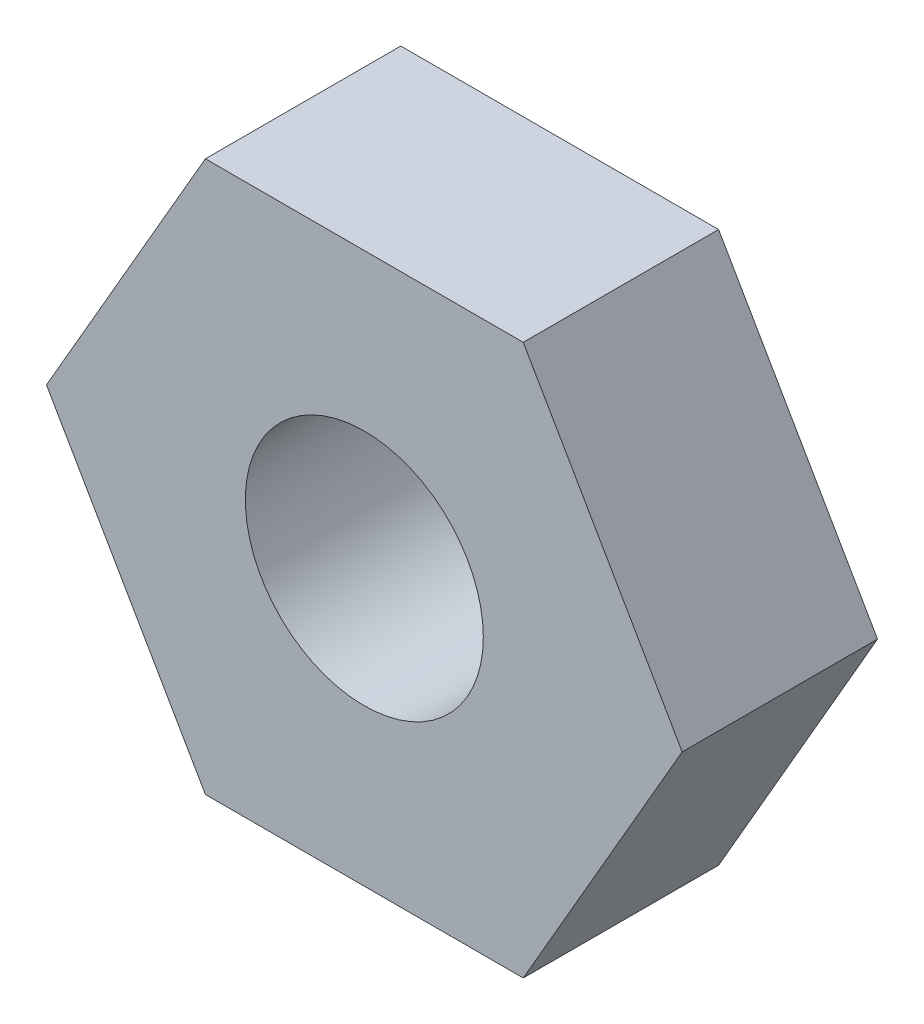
ISO-10303-21;
HEADER;
FILE_DESCRIPTION(('STEP AP214'),'2;1');
FILE_NAME('part.step','',(''),(''),'','','');
FILE_SCHEMA(('AUTOMOTIVE_DESIGN { 1 0 10303 214 1 1 1 1 }'));
ENDSEC;
DATA;
#1=APPLICATION_CONTEXT('core data for automotive mechanical design processes');
#2=APPLICATION_PROTOCOL_DEFINITION('international standard','automotive_design',2000,#1);
#3=PRODUCT_CONTEXT('',#1,'mechanical');
#4=PRODUCT('Part','Part','',(#3));
#5=PRODUCT_RELATED_PRODUCT_CATEGORY('part','',(#4));
#6=PRODUCT_DEFINITION_FORMATION('','',#4);
#7=PRODUCT_DEFINITION_CONTEXT('part definition',#1,'design');
#8=PRODUCT_DEFINITION('design','',#6,#7);
#9=PRODUCT_DEFINITION_SHAPE('','',#8);
#10=(LENGTH_UNIT() NAMED_UNIT(*) SI_UNIT(.MILLI.,.METRE.));
#11=(NAMED_UNIT(*) PLANE_ANGLE_UNIT() SI_UNIT($,.RADIAN.));
#12=(NAMED_UNIT(*) SI_UNIT($,.STERADIAN.) SOLID_ANGLE_UNIT());
#13=UNCERTAINTY_MEASURE_WITH_UNIT(LENGTH_MEASURE(1.E-05),#10,'distance_accuracy_value','');
#14=(GEOMETRIC_REPRESENTATION_CONTEXT(3) GLOBAL_UNCERTAINTY_ASSIGNED_CONTEXT((#13)) GLOBAL_UNIT_ASSIGNED_CONTEXT((#10,
#11,#12)) REPRESENTATION_CONTEXT('',''));
#15=CARTESIAN_POINT('',(0.,0.,0.));
#16=DIRECTION('',(0.,0.,1.));
#17=DIRECTION('',(1.,0.,0.));
#18=AXIS2_PLACEMENT_3D('',#15,#16,#17);
#19=CARTESIAN_POINT('',(2.27302800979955,-3.937,2.794));
#20=DIRECTION('',(-0.866025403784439,0.5,0.));
#21=DIRECTION('',(-0.5,-0.866025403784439,0.));
#22=AXIS2_PLACEMENT_3D('',#19,#20,#21);
#23=PLANE('',#22);
#24=DIRECTION('',(0.5,0.866025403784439,0.));
#25=VECTOR('',#24,1.);
#26=CARTESIAN_POINT('',(2.27302800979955,-3.937,0.));
#27=LINE('',#26,#25);
#28=CARTESIAN_POINT('',(2.27302800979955,-3.937,0.));
#29=VERTEX_POINT('',#28);
#30=CARTESIAN_POINT('',(4.54605601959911,0.,0.));
#31=VERTEX_POINT('',#30);
#32=EDGE_CURVE('E117',#29,#31,#27,.T.);
#33=ORIENTED_EDGE('',*,*,#32,.T.);
#34=DIRECTION('',(0.,0.,-1.));
#35=VECTOR('',#34,1.);
#36=CARTESIAN_POINT('',(4.54605601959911,0.,2.794));
#37=LINE('',#36,#35);
#38=CARTESIAN_POINT('',(4.54605601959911,0.,2.794));
#39=VERTEX_POINT('',#38);
#40=EDGE_CURVE('E11',#39,#31,#37,.T.);
#41=ORIENTED_EDGE('',*,*,#40,.F.);
#42=DIRECTION('',(0.5,0.866025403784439,0.));
#43=VECTOR('',#42,1.);
#44=CARTESIAN_POINT('',(2.27302800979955,-3.937,2.794));
#45=LINE('',#44,#43);
#46=CARTESIAN_POINT('',(2.27302800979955,-3.937,2.794));
#47=VERTEX_POINT('',#46);
#48=EDGE_CURVE('E128',#47,#39,#45,.T.);
#49=ORIENTED_EDGE('',*,*,#48,.F.);
#50=DIRECTION('',(0.,0.,-1.));
#51=VECTOR('',#50,1.);
#52=CARTESIAN_POINT('',(2.27302800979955,-3.937,2.794));
#53=LINE('',#52,#51);
#54=EDGE_CURVE('E113',#47,#29,#53,.T.);
#55=ORIENTED_EDGE('',*,*,#54,.T.);
#56=EDGE_LOOP('',(#33,#41,#49,#55));
#57=FACE_BOUND('',#56,.T.);
#58=ADVANCED_FACE('F33',(#57),#23,.F.);
#59=CARTESIAN_POINT('',(4.54605601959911,0.,2.794));
#60=DIRECTION('',(-0.866025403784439,-0.5,0.));
#61=DIRECTION('',(0.5,-0.866025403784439,0.));
#62=AXIS2_PLACEMENT_3D('',#59,#60,#61);
#63=PLANE('',#62);
#64=DIRECTION('',(-0.5,0.866025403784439,0.));
#65=VECTOR('',#64,1.);
#66=CARTESIAN_POINT('',(4.54605601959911,0.,0.));
#67=LINE('',#66,#65);
#68=CARTESIAN_POINT('',(2.27302800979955,3.937,0.));
#69=VERTEX_POINT('',#68);
#70=EDGE_CURVE('E120',#31,#69,#67,.T.);
#71=ORIENTED_EDGE('',*,*,#70,.T.);
#72=DIRECTION('',(0.,0.,-1.));
#73=VECTOR('',#72,1.);
#74=CARTESIAN_POINT('',(2.27302800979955,3.937,2.794));
#75=LINE('',#74,#73);
#76=CARTESIAN_POINT('',(2.27302800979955,3.937,2.794));
#77=VERTEX_POINT('',#76);
#78=EDGE_CURVE('E41',#77,#69,#75,.T.);
#79=ORIENTED_EDGE('',*,*,#78,.F.);
#80=DIRECTION('',(-0.5,0.866025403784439,0.));
#81=VECTOR('',#80,1.);
#82=CARTESIAN_POINT('',(4.54605601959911,0.,2.794));
#83=LINE('',#82,#81);
#84=EDGE_CURVE('E86',#39,#77,#83,.T.);
#85=ORIENTED_EDGE('',*,*,#84,.F.);
#86=ORIENTED_EDGE('',*,*,#40,.T.);
#87=EDGE_LOOP('',(#71,#79,#85,#86));
#88=FACE_BOUND('',#87,.T.);
#89=ADVANCED_FACE('F153',(#88),#63,.F.);
#90=CARTESIAN_POINT('',(2.27302800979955,3.937,2.794));
#91=DIRECTION('',(0.,-1.,0.));
#92=DIRECTION('',(1.,0.,0.));
#93=AXIS2_PLACEMENT_3D('',#90,#91,#92);
#94=PLANE('',#93);
#95=DIRECTION('',(-1.,0.,0.));
#96=VECTOR('',#95,1.);
#97=CARTESIAN_POINT('',(2.27302800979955,3.937,0.));
#98=LINE('',#97,#96);
#99=CARTESIAN_POINT('',(-2.27302800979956,3.937,0.));
#100=VERTEX_POINT('',#99);
#101=EDGE_CURVE('E123',#69,#100,#98,.T.);
#102=ORIENTED_EDGE('',*,*,#101,.T.);
#103=DIRECTION('',(0.,0.,-1.));
#104=VECTOR('',#103,1.);
#105=CARTESIAN_POINT('',(-2.27302800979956,3.937,2.794));
#106=LINE('',#105,#104);
#107=CARTESIAN_POINT('',(-2.27302800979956,3.937,2.794));
#108=VERTEX_POINT('',#107);
#109=EDGE_CURVE('E108',#108,#100,#106,.T.);
#110=ORIENTED_EDGE('',*,*,#109,.F.);
#111=DIRECTION('',(-1.,0.,0.));
#112=VECTOR('',#111,1.);
#113=CARTESIAN_POINT('',(2.27302800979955,3.937,2.794));
#114=LINE('',#113,#112);
#115=EDGE_CURVE('E99',#77,#108,#114,.T.);
#116=ORIENTED_EDGE('',*,*,#115,.F.);
#117=ORIENTED_EDGE('',*,*,#78,.T.);
#118=EDGE_LOOP('',(#102,#110,#116,#117));
#119=FACE_BOUND('',#118,.T.);
#120=ADVANCED_FACE('F134',(#119),#94,.F.);
#121=CARTESIAN_POINT('',(-2.27302800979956,3.937,2.794));
#122=DIRECTION('',(0.866025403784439,-0.5,0.));
#123=DIRECTION('',(0.5,0.866025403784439,0.));
#124=AXIS2_PLACEMENT_3D('',#121,#122,#123);
#125=PLANE('',#124);
#126=DIRECTION('',(-0.5,-0.866025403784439,0.));
#127=VECTOR('',#126,1.);
#128=CARTESIAN_POINT('',(-2.27302800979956,3.937,0.));
#129=LINE('',#128,#127);
#130=CARTESIAN_POINT('',(-4.54605601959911,0.,0.));
#131=VERTEX_POINT('',#130);
#132=EDGE_CURVE('E107',#100,#131,#129,.T.);
#133=ORIENTED_EDGE('',*,*,#132,.T.);
#134=DIRECTION('',(0.,0.,-1.));
#135=VECTOR('',#134,1.);
#136=CARTESIAN_POINT('',(-4.54605601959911,0.,2.794));
#137=LINE('',#136,#135);
#138=CARTESIAN_POINT('',(-4.54605601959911,0.,2.794));
#139=VERTEX_POINT('',#138);
#140=EDGE_CURVE('E104',#139,#131,#137,.T.);
#141=ORIENTED_EDGE('',*,*,#140,.F.);
#142=DIRECTION('',(-0.5,-0.866025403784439,0.));
#143=VECTOR('',#142,1.);
#144=CARTESIAN_POINT('',(-2.27302800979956,3.937,2.794));
#145=LINE('',#144,#143);
#146=EDGE_CURVE('E93',#108,#139,#145,.T.);
#147=ORIENTED_EDGE('',*,*,#146,.F.);
#148=ORIENTED_EDGE('',*,*,#109,.T.);
#149=EDGE_LOOP('',(#133,#141,#147,#148));
#150=FACE_BOUND('',#149,.T.);
#151=ADVANCED_FACE('F105',(#150),#125,.F.);
#152=CARTESIAN_POINT('',(-4.54605601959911,0.,2.794));
#153=DIRECTION('',(0.866025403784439,0.5,0.));
#154=DIRECTION('',(-0.5,0.866025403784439,0.));
#155=AXIS2_PLACEMENT_3D('',#152,#153,#154);
#156=PLANE('',#155);
#157=DIRECTION('',(0.5,-0.866025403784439,0.));
#158=VECTOR('',#157,1.);
#159=CARTESIAN_POINT('',(-4.54605601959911,0.,0.));
#160=LINE('',#159,#158);
#161=CARTESIAN_POINT('',(-2.27302800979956,-3.937,0.));
#162=VERTEX_POINT('',#161);
#163=EDGE_CURVE('E72',#131,#162,#160,.T.);
#164=ORIENTED_EDGE('',*,*,#163,.T.);
#165=DIRECTION('',(0.,0.,-1.));
#166=VECTOR('',#165,1.);
#167=CARTESIAN_POINT('',(-2.27302800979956,-3.937,2.794));
#168=LINE('',#167,#166);
#169=CARTESIAN_POINT('',(-2.27302800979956,-3.937,2.794));
#170=VERTEX_POINT('',#169);
#171=EDGE_CURVE('E109',#170,#162,#168,.T.);
#172=ORIENTED_EDGE('',*,*,#171,.F.);
#173=DIRECTION('',(0.5,-0.866025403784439,0.));
#174=VECTOR('',#173,1.);
#175=CARTESIAN_POINT('',(-4.54605601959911,0.,2.794));
#176=LINE('',#175,#174);
#177=EDGE_CURVE('E97',#139,#170,#176,.T.);
#178=ORIENTED_EDGE('',*,*,#177,.F.);
#179=ORIENTED_EDGE('',*,*,#140,.T.);
#180=EDGE_LOOP('',(#164,#172,#178,#179));
#181=FACE_BOUND('',#180,.T.);
#182=ADVANCED_FACE('F111',(#181),#156,.F.);
#183=CARTESIAN_POINT('',(-2.27302800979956,-3.937,2.794));
#184=DIRECTION('',(0.,1.,0.));
#185=DIRECTION('',(-1.,0.,0.));
#186=AXIS2_PLACEMENT_3D('',#183,#184,#185);
#187=PLANE('',#186);
#188=DIRECTION('',(1.,0.,0.));
#189=VECTOR('',#188,1.);
#190=CARTESIAN_POINT('',(-2.27302800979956,-3.937,0.));
#191=LINE('',#190,#189);
#192=EDGE_CURVE('E78',#162,#29,#191,.T.);
#193=ORIENTED_EDGE('',*,*,#192,.T.);
#194=ORIENTED_EDGE('',*,*,#54,.F.);
#195=DIRECTION('',(1.,0.,0.));
#196=VECTOR('',#195,1.);
#197=CARTESIAN_POINT('',(-2.27302800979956,-3.937,2.794));
#198=LINE('',#197,#196);
#199=EDGE_CURVE('E49',#170,#47,#198,.T.);
#200=ORIENTED_EDGE('',*,*,#199,.F.);
#201=ORIENTED_EDGE('',*,*,#171,.T.);
#202=EDGE_LOOP('',(#193,#194,#200,#201));
#203=FACE_BOUND('',#202,.T.);
#204=ADVANCED_FACE('F141',(#203),#187,.F.);
#205=CARTESIAN_POINT('',(0.,0.,2.794));
#206=DIRECTION('',(0.,0.,1.));
#207=DIRECTION('',(1.,0.,0.));
#208=AXIS2_PLACEMENT_3D('',#205,#206,#207);
#209=PLANE('',#208);
#210=CARTESIAN_POINT('',(0.,0.,2.794));
#211=DIRECTION('',(0.,0.,1.));
#212=DIRECTION('',(1.,0.,0.));
#213=AXIS2_PLACEMENT_3D('',#210,#211,#212);
#214=CIRCLE('',#213,1.7018);
#215=CARTESIAN_POINT('',(1.7018,0.,2.794));
#216=VERTEX_POINT('',#215);
#217=EDGE_CURVE('E208',#216,#216,#214,.T.);
#218=ORIENTED_EDGE('',*,*,#217,.F.);
#219=EDGE_LOOP('',(#218));
#220=FACE_BOUND('',#219,.T.);
#221=ORIENTED_EDGE('',*,*,#48,.T.);
#222=ORIENTED_EDGE('',*,*,#84,.T.);
#223=ORIENTED_EDGE('',*,*,#115,.T.);
#224=ORIENTED_EDGE('',*,*,#146,.T.);
#225=ORIENTED_EDGE('',*,*,#177,.T.);
#226=ORIENTED_EDGE('',*,*,#199,.T.);
#227=EDGE_LOOP('',(#221,#222,#223,#224,#225,#226));
#228=FACE_BOUND('',#227,.T.);
#229=ADVANCED_FACE('F95',(#220,#228),#209,.T.);
#230=CARTESIAN_POINT('',(0.,0.,0.));
#231=DIRECTION('',(0.,0.,1.));
#232=DIRECTION('',(1.,0.,0.));
#233=AXIS2_PLACEMENT_3D('',#230,#231,#232);
#234=PLANE('',#233);
#235=CARTESIAN_POINT('',(0.,0.,0.));
#236=DIRECTION('',(0.,0.,1.));
#237=DIRECTION('',(1.,0.,0.));
#238=AXIS2_PLACEMENT_3D('',#235,#236,#237);
#239=CIRCLE('',#238,1.7018);
#240=CARTESIAN_POINT('',(1.7018,0.,0.));
#241=VERTEX_POINT('',#240);
#242=EDGE_CURVE('E121',#241,#241,#239,.T.);
#243=ORIENTED_EDGE('',*,*,#242,.T.);
#244=EDGE_LOOP('',(#243));
#245=FACE_BOUND('',#244,.T.);
#246=ORIENTED_EDGE('',*,*,#32,.F.);
#247=ORIENTED_EDGE('',*,*,#192,.F.);
#248=ORIENTED_EDGE('',*,*,#163,.F.);
#249=ORIENTED_EDGE('',*,*,#132,.F.);
#250=ORIENTED_EDGE('',*,*,#101,.F.);
#251=ORIENTED_EDGE('',*,*,#70,.F.);
#252=EDGE_LOOP('',(#246,#247,#248,#249,#250,#251));
#253=FACE_BOUND('',#252,.T.);
#254=ADVANCED_FACE('F137',(#245,#253),#234,.F.);
#255=CARTESIAN_POINT('',(0.,0.,0.));
#256=DIRECTION('',(0.,0.,1.));
#257=DIRECTION('',(1.,0.,0.));
#258=AXIS2_PLACEMENT_3D('',#255,#256,#257);
#259=CYLINDRICAL_SURFACE('',#258,1.7018);
#260=ORIENTED_EDGE('',*,*,#242,.F.);
#261=EDGE_LOOP('',(#260));
#262=FACE_BOUND('',#261,.T.);
#263=ORIENTED_EDGE('',*,*,#217,.T.);
#264=EDGE_LOOP('',(#263));
#265=FACE_BOUND('',#264,.T.);
#266=ADVANCED_FACE('F190',(#262,#265),#259,.F.);
#267=CLOSED_SHELL('',(#58,#89,#120,#151,#182,#204,#229,#254,#266));
#268=MANIFOLD_SOLID_BREP('B2',#267);
#269=ADVANCED_BREP_SHAPE_REPRESENTATION('',(#18,#268),#14);
#270=SHAPE_DEFINITION_REPRESENTATION(#9,#269);
ENDSEC;
END-ISO-10303-21;
